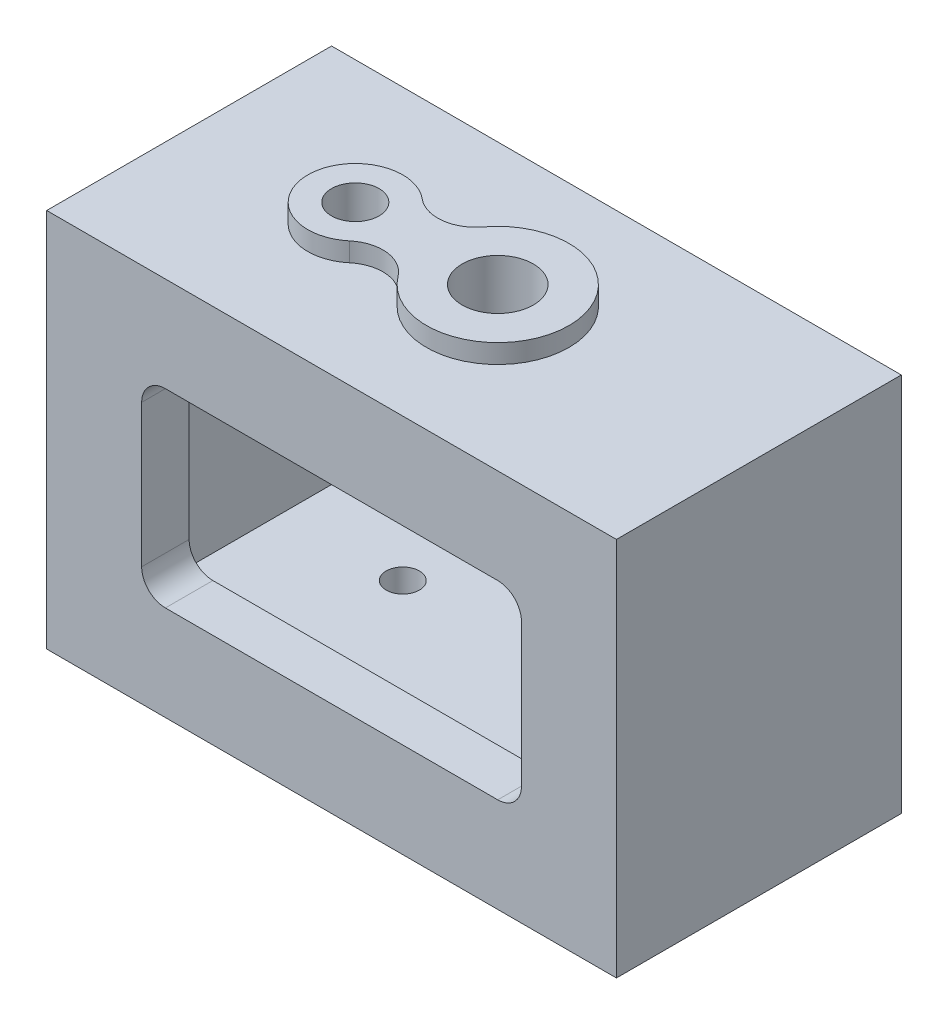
ISO-10303-21;
HEADER;
FILE_DESCRIPTION(('STEP AP214'),'2;1');
FILE_NAME('part.step','',(''),(''),'','','');
FILE_SCHEMA(('AUTOMOTIVE_DESIGN { 1 0 10303 214 1 1 1 1 }'));
ENDSEC;
DATA;
#1=APPLICATION_CONTEXT('core data for automotive mechanical design processes');
#2=APPLICATION_PROTOCOL_DEFINITION('international standard','automotive_design',2000,#1);
#3=PRODUCT_CONTEXT('',#1,'mechanical');
#4=PRODUCT('Part','Part','',(#3));
#5=PRODUCT_RELATED_PRODUCT_CATEGORY('part','',(#4));
#6=PRODUCT_DEFINITION_FORMATION('','',#4);
#7=PRODUCT_DEFINITION_CONTEXT('part definition',#1,'design');
#8=PRODUCT_DEFINITION('design','',#6,#7);
#9=PRODUCT_DEFINITION_SHAPE('','',#8);
#10=(LENGTH_UNIT() NAMED_UNIT(*) SI_UNIT(.MILLI.,.METRE.));
#11=(NAMED_UNIT(*) PLANE_ANGLE_UNIT() SI_UNIT($,.RADIAN.));
#12=(NAMED_UNIT(*) SI_UNIT($,.STERADIAN.) SOLID_ANGLE_UNIT());
#13=UNCERTAINTY_MEASURE_WITH_UNIT(LENGTH_MEASURE(1.E-05),#10,'distance_accuracy_value','');
#14=(GEOMETRIC_REPRESENTATION_CONTEXT(3) GLOBAL_UNCERTAINTY_ASSIGNED_CONTEXT((#13)) GLOBAL_UNIT_ASSIGNED_CONTEXT((#10,
#11,#12)) REPRESENTATION_CONTEXT('',''));
#15=CARTESIAN_POINT('',(0.,0.,0.));
#16=DIRECTION('',(0.,0.,1.));
#17=DIRECTION('',(1.,0.,0.));
#18=AXIS2_PLACEMENT_3D('',#15,#16,#17);
#19=CARTESIAN_POINT('',(-60.,-10.,-30.));
#20=DIRECTION('',(0.,-1.,0.));
#21=DIRECTION('',(0.,0.,-1.));
#22=AXIS2_PLACEMENT_3D('',#19,#20,#21);
#23=PLANE('',#22);
#24=DIRECTION('',(0.,0.,-1.));
#25=VECTOR('',#24,1.);
#26=CARTESIAN_POINT('',(-60.,-10.,30.));
#27=LINE('',#26,#25);
#28=CARTESIAN_POINT('',(-60.,-10.,30.));
#29=VERTEX_POINT('',#28);
#30=CARTESIAN_POINT('',(-60.,-10.,-30.));
#31=VERTEX_POINT('',#30);
#32=EDGE_CURVE('E246',#29,#31,#27,.T.);
#33=ORIENTED_EDGE('',*,*,#32,.T.);
#34=DIRECTION('',(1.,0.,0.));
#35=VECTOR('',#34,1.);
#36=CARTESIAN_POINT('',(-60.,-10.,-30.));
#37=LINE('',#36,#35);
#38=CARTESIAN_POINT('',(60.,-10.,-30.));
#39=VERTEX_POINT('',#38);
#40=EDGE_CURVE('E262',#31,#39,#37,.T.);
#41=ORIENTED_EDGE('',*,*,#40,.T.);
#42=DIRECTION('',(0.,0.,1.));
#43=VECTOR('',#42,1.);
#44=CARTESIAN_POINT('',(60.,-10.,30.));
#45=LINE('',#44,#43);
#46=CARTESIAN_POINT('',(60.,-10.,30.));
#47=VERTEX_POINT('',#46);
#48=EDGE_CURVE('E265',#39,#47,#45,.T.);
#49=ORIENTED_EDGE('',*,*,#48,.T.);
#50=DIRECTION('',(-1.,0.,0.));
#51=VECTOR('',#50,1.);
#52=CARTESIAN_POINT('',(-60.,-10.,30.));
#53=LINE('',#52,#51);
#54=EDGE_CURVE('E268',#47,#29,#53,.T.);
#55=ORIENTED_EDGE('',*,*,#54,.T.);
#56=EDGE_LOOP('',(#33,#41,#49,#55));
#57=FACE_BOUND('',#56,.T.);
#58=CARTESIAN_POINT('',(-25.,-10.,-10.));
#59=DIRECTION('',(0.,-1.,0.));
#60=DIRECTION('',(0.,0.,-1.));
#61=AXIS2_PLACEMENT_3D('',#58,#59,#60);
#62=CIRCLE('',#61,7.);
#63=CARTESIAN_POINT('',(-25.,-10.,-17.));
#64=VERTEX_POINT('',#63);
#65=EDGE_CURVE('E367',#64,#64,#62,.T.);
#66=ORIENTED_EDGE('',*,*,#65,.F.);
#67=EDGE_LOOP('',(#66));
#68=FACE_BOUND('',#67,.T.);
#69=ADVANCED_FACE('F31',(#57,#68),#23,.T.);
#70=CARTESIAN_POINT('',(-60.,70.,30.));
#71=DIRECTION('',(0.,1.,0.));
#72=DIRECTION('',(0.,0.,1.));
#73=AXIS2_PLACEMENT_3D('',#70,#71,#72);
#74=PLANE('',#73);
#75=DIRECTION('',(0.,0.,1.));
#76=VECTOR('',#75,1.);
#77=CARTESIAN_POINT('',(-60.,70.,-30.));
#78=LINE('',#77,#76);
#79=CARTESIAN_POINT('',(-60.,70.,-30.));
#80=VERTEX_POINT('',#79);
#81=CARTESIAN_POINT('',(-60.,70.,30.));
#82=VERTEX_POINT('',#81);
#83=EDGE_CURVE('E271',#80,#82,#78,.T.);
#84=ORIENTED_EDGE('',*,*,#83,.T.);
#85=DIRECTION('',(1.,0.,0.));
#86=VECTOR('',#85,1.);
#87=CARTESIAN_POINT('',(-60.,70.,30.));
#88=LINE('',#87,#86);
#89=CARTESIAN_POINT('',(60.,70.,30.));
#90=VERTEX_POINT('',#89);
#91=EDGE_CURVE('E274',#82,#90,#88,.T.);
#92=ORIENTED_EDGE('',*,*,#91,.T.);
#93=DIRECTION('',(0.,0.,-1.));
#94=VECTOR('',#93,1.);
#95=CARTESIAN_POINT('',(60.,70.,-30.));
#96=LINE('',#95,#94);
#97=CARTESIAN_POINT('',(60.,70.,-30.));
#98=VERTEX_POINT('',#97);
#99=EDGE_CURVE('E277',#90,#98,#96,.T.);
#100=ORIENTED_EDGE('',*,*,#99,.T.);
#101=DIRECTION('',(-1.,0.,0.));
#102=VECTOR('',#101,1.);
#103=CARTESIAN_POINT('',(-60.,70.,-30.));
#104=LINE('',#103,#102);
#105=EDGE_CURVE('E280',#98,#80,#104,.T.);
#106=ORIENTED_EDGE('',*,*,#105,.T.);
#107=EDGE_LOOP('',(#84,#92,#100,#106));
#108=FACE_BOUND('',#107,.T.);
#109=CARTESIAN_POINT('',(-25.,70.,0.));
#110=DIRECTION('',(0.,1.,0.));
#111=DIRECTION('',(0.,0.,1.));
#112=AXIS2_PLACEMENT_3D('',#109,#110,#111);
#113=CIRCLE('',#112,10.);
#114=CARTESIAN_POINT('',(-18.5648148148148,70.,-7.65430543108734));
#115=VERTEX_POINT('',#114);
#116=CARTESIAN_POINT('',(-18.5648148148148,70.,7.65430543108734));
#117=VERTEX_POINT('',#116);
#118=EDGE_CURVE('E342',#115,#117,#113,.T.);
#119=ORIENTED_EDGE('',*,*,#118,.F.);
#120=CARTESIAN_POINT('',(-13.4166666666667,70.,-13.7777497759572));
#121=DIRECTION('',(0.,-1.,0.));
#122=DIRECTION('',(0.,0.,1.));
#123=AXIS2_PLACEMENT_3D('',#120,#121,#122);
#124=CIRCLE('',#123,8.);
#125=CARTESIAN_POINT('',(-7.01086956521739,70.,-8.98548898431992));
#126=VERTEX_POINT('',#125);
#127=EDGE_CURVE('E191',#126,#115,#124,.T.);
#128=ORIENTED_EDGE('',*,*,#127,.F.);
#129=CARTESIAN_POINT('',(5.,70.,0.));
#130=DIRECTION('',(0.,1.,0.));
#131=DIRECTION('',(0.,0.,1.));
#132=AXIS2_PLACEMENT_3D('',#129,#130,#131);
#133=CIRCLE('',#132,15.);
#134=CARTESIAN_POINT('',(-7.01086956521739,70.,8.98548898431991));
#135=VERTEX_POINT('',#134);
#136=EDGE_CURVE('E187',#135,#126,#133,.T.);
#137=ORIENTED_EDGE('',*,*,#136,.F.);
#138=CARTESIAN_POINT('',(-13.4166666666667,70.,13.7777497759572));
#139=DIRECTION('',(0.,-1.,0.));
#140=DIRECTION('',(0.,0.,-1.));
#141=AXIS2_PLACEMENT_3D('',#138,#139,#140);
#142=CIRCLE('',#141,8.);
#143=EDGE_CURVE('E344',#117,#135,#142,.T.);
#144=ORIENTED_EDGE('',*,*,#143,.F.);
#145=EDGE_LOOP('',(#119,#128,#137,#144));
#146=FACE_BOUND('',#145,.T.);
#147=ADVANCED_FACE('F337',(#108,#146),#74,.T.);
#148=CARTESIAN_POINT('',(-60.,60.,-30.));
#149=DIRECTION('',(1.,0.,0.));
#150=DIRECTION('',(0.,0.,-1.));
#151=AXIS2_PLACEMENT_3D('',#148,#149,#150);
#152=PLANE('',#151);
#153=DIRECTION('',(0.,-1.,0.));
#154=VECTOR('',#153,1.);
#155=CARTESIAN_POINT('',(-60.,60.,-30.));
#156=LINE('',#155,#154);
#157=EDGE_CURVE('E316',#80,#31,#156,.T.);
#158=ORIENTED_EDGE('',*,*,#157,.T.);
#159=ORIENTED_EDGE('',*,*,#32,.F.);
#160=DIRECTION('',(0.,-1.,0.));
#161=VECTOR('',#160,1.);
#162=CARTESIAN_POINT('',(-60.,60.,30.));
#163=LINE('',#162,#161);
#164=EDGE_CURVE('E11',#82,#29,#163,.T.);
#165=ORIENTED_EDGE('',*,*,#164,.F.);
#166=ORIENTED_EDGE('',*,*,#83,.F.);
#167=EDGE_LOOP('',(#158,#159,#165,#166));
#168=FACE_BOUND('',#167,.T.);
#169=ADVANCED_FACE('F33',(#168),#152,.F.);
#170=CARTESIAN_POINT('',(-60.,60.,30.));
#171=DIRECTION('',(0.,0.,-1.));
#172=DIRECTION('',(-1.,0.,0.));
#173=AXIS2_PLACEMENT_3D('',#170,#171,#172);
#174=PLANE('',#173);
#175=DIRECTION('',(0.,-1.,0.));
#176=VECTOR('',#175,1.);
#177=CARTESIAN_POINT('',(-40.,45.,30.));
#178=LINE('',#177,#176);
#179=CARTESIAN_POINT('',(-40.,45.,30.));
#180=VERTEX_POINT('',#179);
#181=CARTESIAN_POINT('',(-40.,15.,30.));
#182=VERTEX_POINT('',#181);
#183=EDGE_CURVE('E194',#180,#182,#178,.T.);
#184=ORIENTED_EDGE('',*,*,#183,.F.);
#185=CARTESIAN_POINT('',(-35.,45.,30.));
#186=DIRECTION('',(0.,0.,1.));
#187=DIRECTION('',(-1.,0.,0.));
#188=AXIS2_PLACEMENT_3D('',#185,#186,#187);
#189=CIRCLE('',#188,5.);
#190=CARTESIAN_POINT('',(-35.,50.,30.));
#191=VERTEX_POINT('',#190);
#192=EDGE_CURVE('E54',#191,#180,#189,.T.);
#193=ORIENTED_EDGE('',*,*,#192,.F.);
#194=DIRECTION('',(-1.,0.,0.));
#195=VECTOR('',#194,1.);
#196=CARTESIAN_POINT('',(35.,50.,30.));
#197=LINE('',#196,#195);
#198=CARTESIAN_POINT('',(35.,50.,30.));
#199=VERTEX_POINT('',#198);
#200=EDGE_CURVE('E203',#199,#191,#197,.T.);
#201=ORIENTED_EDGE('',*,*,#200,.F.);
#202=CARTESIAN_POINT('',(35.,45.,30.));
#203=DIRECTION('',(0.,0.,1.));
#204=DIRECTION('',(1.,0.,0.));
#205=AXIS2_PLACEMENT_3D('',#202,#203,#204);
#206=CIRCLE('',#205,5.);
#207=CARTESIAN_POINT('',(40.,45.,30.));
#208=VERTEX_POINT('',#207);
#209=EDGE_CURVE('E239',#208,#199,#206,.T.);
#210=ORIENTED_EDGE('',*,*,#209,.F.);
#211=DIRECTION('',(0.,1.,0.));
#212=VECTOR('',#211,1.);
#213=CARTESIAN_POINT('',(40.,15.,30.));
#214=LINE('',#213,#212);
#215=CARTESIAN_POINT('',(40.,15.,30.));
#216=VERTEX_POINT('',#215);
#217=EDGE_CURVE('E236',#216,#208,#214,.T.);
#218=ORIENTED_EDGE('',*,*,#217,.F.);
#219=CARTESIAN_POINT('',(35.,15.,30.));
#220=DIRECTION('',(0.,0.,1.));
#221=DIRECTION('',(1.,0.,0.));
#222=AXIS2_PLACEMENT_3D('',#219,#220,#221);
#223=CIRCLE('',#222,5.);
#224=CARTESIAN_POINT('',(35.,10.,30.));
#225=VERTEX_POINT('',#224);
#226=EDGE_CURVE('E233',#225,#216,#223,.T.);
#227=ORIENTED_EDGE('',*,*,#226,.F.);
#228=DIRECTION('',(1.,0.,0.));
#229=VECTOR('',#228,1.);
#230=CARTESIAN_POINT('',(-35.,10.,30.));
#231=LINE('',#230,#229);
#232=CARTESIAN_POINT('',(-35.,10.,30.));
#233=VERTEX_POINT('',#232);
#234=EDGE_CURVE('E230',#233,#225,#231,.T.);
#235=ORIENTED_EDGE('',*,*,#234,.F.);
#236=CARTESIAN_POINT('',(-35.,15.,30.));
#237=DIRECTION('',(0.,0.,1.));
#238=DIRECTION('',(-1.,0.,0.));
#239=AXIS2_PLACEMENT_3D('',#236,#237,#238);
#240=CIRCLE('',#239,5.);
#241=EDGE_CURVE('E227',#182,#233,#240,.T.);
#242=ORIENTED_EDGE('',*,*,#241,.F.);
#243=EDGE_LOOP('',(#184,#193,#201,#210,#218,#227,#235,#242));
#244=FACE_BOUND('',#243,.T.);
#245=ORIENTED_EDGE('',*,*,#164,.T.);
#246=ORIENTED_EDGE('',*,*,#54,.F.);
#247=DIRECTION('',(0.,-1.,0.));
#248=VECTOR('',#247,1.);
#249=CARTESIAN_POINT('',(60.,60.,30.));
#250=LINE('',#249,#248);
#251=EDGE_CURVE('E39',#90,#47,#250,.T.);
#252=ORIENTED_EDGE('',*,*,#251,.F.);
#253=ORIENTED_EDGE('',*,*,#91,.F.);
#254=EDGE_LOOP('',(#245,#246,#252,#253));
#255=FACE_BOUND('',#254,.T.);
#256=ADVANCED_FACE('F330',(#244,#255),#174,.F.);
#257=CARTESIAN_POINT('',(60.,60.,-30.));
#258=DIRECTION('',(-1.,0.,0.));
#259=DIRECTION('',(0.,0.,1.));
#260=AXIS2_PLACEMENT_3D('',#257,#258,#259);
#261=PLANE('',#260);
#262=ORIENTED_EDGE('',*,*,#251,.T.);
#263=ORIENTED_EDGE('',*,*,#48,.F.);
#264=DIRECTION('',(0.,-1.,0.));
#265=VECTOR('',#264,1.);
#266=CARTESIAN_POINT('',(60.,60.,-30.));
#267=LINE('',#266,#265);
#268=EDGE_CURVE('E318',#98,#39,#267,.T.);
#269=ORIENTED_EDGE('',*,*,#268,.F.);
#270=ORIENTED_EDGE('',*,*,#99,.F.);
#271=EDGE_LOOP('',(#262,#263,#269,#270));
#272=FACE_BOUND('',#271,.T.);
#273=ADVANCED_FACE('F322',(#272),#261,.F.);
#274=CARTESIAN_POINT('',(-60.,60.,-30.));
#275=DIRECTION('',(0.,0.,1.));
#276=DIRECTION('',(1.,0.,0.));
#277=AXIS2_PLACEMENT_3D('',#274,#275,#276);
#278=PLANE('',#277);
#279=ORIENTED_EDGE('',*,*,#268,.T.);
#280=ORIENTED_EDGE('',*,*,#40,.F.);
#281=ORIENTED_EDGE('',*,*,#157,.F.);
#282=ORIENTED_EDGE('',*,*,#105,.F.);
#283=EDGE_LOOP('',(#279,#280,#281,#282));
#284=FACE_BOUND('',#283,.T.);
#285=ADVANCED_FACE('F335',(#284),#278,.F.);
#286=CARTESIAN_POINT('',(-35.,45.,20.));
#287=DIRECTION('',(0.,0.,1.));
#288=DIRECTION('',(1.,0.,0.));
#289=AXIS2_PLACEMENT_3D('',#286,#287,#288);
#290=CYLINDRICAL_SURFACE('',#289,5.);
#291=ORIENTED_EDGE('',*,*,#192,.T.);
#292=DIRECTION('',(0.,0.,1.));
#293=VECTOR('',#292,1.);
#294=CARTESIAN_POINT('',(-40.,45.,20.));
#295=LINE('',#294,#293);
#296=CARTESIAN_POINT('',(-40.,45.,20.));
#297=VERTEX_POINT('',#296);
#298=EDGE_CURVE('E223',#297,#180,#295,.T.);
#299=ORIENTED_EDGE('',*,*,#298,.F.);
#300=CARTESIAN_POINT('',(-35.,45.,20.));
#301=DIRECTION('',(0.,0.,1.));
#302=DIRECTION('',(-1.,0.,0.));
#303=AXIS2_PLACEMENT_3D('',#300,#301,#302);
#304=CIRCLE('',#303,5.);
#305=CARTESIAN_POINT('',(-35.,50.,20.));
#306=VERTEX_POINT('',#305);
#307=EDGE_CURVE('E199',#306,#297,#304,.T.);
#308=ORIENTED_EDGE('',*,*,#307,.F.);
#309=DIRECTION('',(0.,0.,1.));
#310=VECTOR('',#309,1.);
#311=CARTESIAN_POINT('',(-35.,50.,20.));
#312=LINE('',#311,#310);
#313=EDGE_CURVE('E244',#306,#191,#312,.T.);
#314=ORIENTED_EDGE('',*,*,#313,.T.);
#315=EDGE_LOOP('',(#291,#299,#308,#314));
#316=FACE_BOUND('',#315,.T.);
#317=ADVANCED_FACE('F400',(#316),#290,.F.);
#318=CARTESIAN_POINT('',(35.,50.,20.));
#319=DIRECTION('',(0.,1.,0.));
#320=DIRECTION('',(0.,0.,1.));
#321=AXIS2_PLACEMENT_3D('',#318,#319,#320);
#322=PLANE('',#321);
#323=ORIENTED_EDGE('',*,*,#200,.T.);
#324=ORIENTED_EDGE('',*,*,#313,.F.);
#325=DIRECTION('',(-1.,0.,0.));
#326=VECTOR('',#325,1.);
#327=CARTESIAN_POINT('',(35.,50.,20.));
#328=LINE('',#327,#326);
#329=CARTESIAN_POINT('',(35.,50.,20.));
#330=VERTEX_POINT('',#329);
#331=EDGE_CURVE('E221',#330,#306,#328,.T.);
#332=ORIENTED_EDGE('',*,*,#331,.F.);
#333=DIRECTION('',(0.,0.,1.));
#334=VECTOR('',#333,1.);
#335=CARTESIAN_POINT('',(35.,50.,20.));
#336=LINE('',#335,#334);
#337=EDGE_CURVE('E247',#330,#199,#336,.T.);
#338=ORIENTED_EDGE('',*,*,#337,.T.);
#339=EDGE_LOOP('',(#323,#324,#332,#338));
#340=FACE_BOUND('',#339,.T.);
#341=ADVANCED_FACE('F445',(#340),#322,.F.);
#342=CARTESIAN_POINT('',(35.,45.,20.));
#343=DIRECTION('',(0.,0.,1.));
#344=DIRECTION('',(1.,0.,0.));
#345=AXIS2_PLACEMENT_3D('',#342,#343,#344);
#346=CYLINDRICAL_SURFACE('',#345,5.);
#347=ORIENTED_EDGE('',*,*,#209,.T.);
#348=ORIENTED_EDGE('',*,*,#337,.F.);
#349=CARTESIAN_POINT('',(35.,45.,20.));
#350=DIRECTION('',(0.,0.,1.));
#351=DIRECTION('',(1.,0.,0.));
#352=AXIS2_PLACEMENT_3D('',#349,#350,#351);
#353=CIRCLE('',#352,5.);
#354=CARTESIAN_POINT('',(40.,45.,20.));
#355=VERTEX_POINT('',#354);
#356=EDGE_CURVE('E218',#355,#330,#353,.T.);
#357=ORIENTED_EDGE('',*,*,#356,.F.);
#358=DIRECTION('',(0.,0.,1.));
#359=VECTOR('',#358,1.);
#360=CARTESIAN_POINT('',(40.,45.,20.));
#361=LINE('',#360,#359);
#362=EDGE_CURVE('E249',#355,#208,#361,.T.);
#363=ORIENTED_EDGE('',*,*,#362,.T.);
#364=EDGE_LOOP('',(#347,#348,#357,#363));
#365=FACE_BOUND('',#364,.T.);
#366=ADVANCED_FACE('F450',(#365),#346,.F.);
#367=CARTESIAN_POINT('',(40.,15.,20.));
#368=DIRECTION('',(1.,0.,0.));
#369=DIRECTION('',(0.,0.,-1.));
#370=AXIS2_PLACEMENT_3D('',#367,#368,#369);
#371=PLANE('',#370);
#372=ORIENTED_EDGE('',*,*,#217,.T.);
#373=ORIENTED_EDGE('',*,*,#362,.F.);
#374=DIRECTION('',(0.,1.,0.));
#375=VECTOR('',#374,1.);
#376=CARTESIAN_POINT('',(40.,15.,20.));
#377=LINE('',#376,#375);
#378=CARTESIAN_POINT('',(40.,15.,20.));
#379=VERTEX_POINT('',#378);
#380=EDGE_CURVE('E215',#379,#355,#377,.T.);
#381=ORIENTED_EDGE('',*,*,#380,.F.);
#382=DIRECTION('',(0.,0.,1.));
#383=VECTOR('',#382,1.);
#384=CARTESIAN_POINT('',(40.,15.,20.));
#385=LINE('',#384,#383);
#386=EDGE_CURVE('E251',#379,#216,#385,.T.);
#387=ORIENTED_EDGE('',*,*,#386,.T.);
#388=EDGE_LOOP('',(#372,#373,#381,#387));
#389=FACE_BOUND('',#388,.T.);
#390=ADVANCED_FACE('F453',(#389),#371,.F.);
#391=CARTESIAN_POINT('',(35.,15.,20.));
#392=DIRECTION('',(0.,0.,1.));
#393=DIRECTION('',(1.,0.,0.));
#394=AXIS2_PLACEMENT_3D('',#391,#392,#393);
#395=CYLINDRICAL_SURFACE('',#394,5.);
#396=ORIENTED_EDGE('',*,*,#226,.T.);
#397=ORIENTED_EDGE('',*,*,#386,.F.);
#398=CARTESIAN_POINT('',(35.,15.,20.));
#399=DIRECTION('',(0.,0.,1.));
#400=DIRECTION('',(1.,0.,0.));
#401=AXIS2_PLACEMENT_3D('',#398,#399,#400);
#402=CIRCLE('',#401,5.);
#403=CARTESIAN_POINT('',(35.,10.,20.));
#404=VERTEX_POINT('',#403);
#405=EDGE_CURVE('E212',#404,#379,#402,.T.);
#406=ORIENTED_EDGE('',*,*,#405,.F.);
#407=DIRECTION('',(0.,0.,1.));
#408=VECTOR('',#407,1.);
#409=CARTESIAN_POINT('',(35.,10.,20.));
#410=LINE('',#409,#408);
#411=EDGE_CURVE('E253',#404,#225,#410,.T.);
#412=ORIENTED_EDGE('',*,*,#411,.T.);
#413=EDGE_LOOP('',(#396,#397,#406,#412));
#414=FACE_BOUND('',#413,.T.);
#415=ADVANCED_FACE('F456',(#414),#395,.F.);
#416=CARTESIAN_POINT('',(-35.,10.,20.));
#417=DIRECTION('',(0.,-1.,0.));
#418=DIRECTION('',(0.,0.,-1.));
#419=AXIS2_PLACEMENT_3D('',#416,#417,#418);
#420=PLANE('',#419);
#421=ORIENTED_EDGE('',*,*,#234,.T.);
#422=ORIENTED_EDGE('',*,*,#411,.F.);
#423=DIRECTION('',(1.,0.,0.));
#424=VECTOR('',#423,1.);
#425=CARTESIAN_POINT('',(-35.,10.,20.));
#426=LINE('',#425,#424);
#427=CARTESIAN_POINT('',(-35.,10.,20.));
#428=VERTEX_POINT('',#427);
#429=EDGE_CURVE('E209',#428,#404,#426,.T.);
#430=ORIENTED_EDGE('',*,*,#429,.F.);
#431=DIRECTION('',(0.,0.,1.));
#432=VECTOR('',#431,1.);
#433=CARTESIAN_POINT('',(-35.,10.,20.));
#434=LINE('',#433,#432);
#435=EDGE_CURVE('E255',#428,#233,#434,.T.);
#436=ORIENTED_EDGE('',*,*,#435,.T.);
#437=EDGE_LOOP('',(#421,#422,#430,#436));
#438=FACE_BOUND('',#437,.T.);
#439=ADVANCED_FACE('F458',(#438),#420,.F.);
#440=CARTESIAN_POINT('',(-35.,15.,20.));
#441=DIRECTION('',(0.,0.,1.));
#442=DIRECTION('',(1.,0.,0.));
#443=AXIS2_PLACEMENT_3D('',#440,#441,#442);
#444=CYLINDRICAL_SURFACE('',#443,5.);
#445=ORIENTED_EDGE('',*,*,#241,.T.);
#446=ORIENTED_EDGE('',*,*,#435,.F.);
#447=CARTESIAN_POINT('',(-35.,15.,20.));
#448=DIRECTION('',(0.,0.,1.));
#449=DIRECTION('',(-1.,0.,0.));
#450=AXIS2_PLACEMENT_3D('',#447,#448,#449);
#451=CIRCLE('',#450,5.);
#452=CARTESIAN_POINT('',(-40.,15.,20.));
#453=VERTEX_POINT('',#452);
#454=EDGE_CURVE('E206',#453,#428,#451,.T.);
#455=ORIENTED_EDGE('',*,*,#454,.F.);
#456=DIRECTION('',(0.,0.,1.));
#457=VECTOR('',#456,1.);
#458=CARTESIAN_POINT('',(-40.,15.,20.));
#459=LINE('',#458,#457);
#460=EDGE_CURVE('E257',#453,#182,#459,.T.);
#461=ORIENTED_EDGE('',*,*,#460,.T.);
#462=EDGE_LOOP('',(#445,#446,#455,#461));
#463=FACE_BOUND('',#462,.T.);
#464=ADVANCED_FACE('F461',(#463),#444,.F.);
#465=CARTESIAN_POINT('',(-40.,45.,20.));
#466=DIRECTION('',(-1.,0.,0.));
#467=DIRECTION('',(0.,0.,1.));
#468=AXIS2_PLACEMENT_3D('',#465,#466,#467);
#469=PLANE('',#468);
#470=ORIENTED_EDGE('',*,*,#183,.T.);
#471=ORIENTED_EDGE('',*,*,#460,.F.);
#472=DIRECTION('',(0.,-1.,0.));
#473=VECTOR('',#472,1.);
#474=CARTESIAN_POINT('',(-40.,45.,20.));
#475=LINE('',#474,#473);
#476=EDGE_CURVE('E202',#297,#453,#475,.T.);
#477=ORIENTED_EDGE('',*,*,#476,.F.);
#478=ORIENTED_EDGE('',*,*,#298,.T.);
#479=EDGE_LOOP('',(#470,#471,#477,#478));
#480=FACE_BOUND('',#479,.T.);
#481=ADVANCED_FACE('F404',(#480),#469,.F.);
#482=CARTESIAN_POINT('',(-60.,0.,-30.));
#483=DIRECTION('',(0.,-1.,0.));
#484=DIRECTION('',(0.,0.,-1.));
#485=AXIS2_PLACEMENT_3D('',#482,#483,#484);
#486=PLANE('',#485);
#487=CARTESIAN_POINT('',(-25.,0.,-10.));
#488=DIRECTION('',(0.,-1.,0.));
#489=DIRECTION('',(0.,0.,-1.));
#490=AXIS2_PLACEMENT_3D('',#487,#488,#489);
#491=CIRCLE('',#490,3.5);
#492=CARTESIAN_POINT('',(-25.,0.,-13.5));
#493=VERTEX_POINT('',#492);
#494=EDGE_CURVE('E375',#493,#493,#491,.T.);
#495=ORIENTED_EDGE('',*,*,#494,.T.);
#496=EDGE_LOOP('',(#495));
#497=FACE_BOUND('',#496,.T.);
#498=DIRECTION('',(-1.,0.,0.));
#499=VECTOR('',#498,1.);
#500=CARTESIAN_POINT('',(-50.,0.,-20.));
#501=LINE('',#500,#499);
#502=CARTESIAN_POINT('',(50.,0.,-20.));
#503=VERTEX_POINT('',#502);
#504=CARTESIAN_POINT('',(-50.,0.,-20.));
#505=VERTEX_POINT('',#504);
#506=EDGE_CURVE('E283',#503,#505,#501,.T.);
#507=ORIENTED_EDGE('',*,*,#506,.T.);
#508=DIRECTION('',(0.,0.,1.));
#509=VECTOR('',#508,1.);
#510=CARTESIAN_POINT('',(-50.,0.,-20.));
#511=LINE('',#510,#509);
#512=CARTESIAN_POINT('',(-50.,0.,20.));
#513=VERTEX_POINT('',#512);
#514=EDGE_CURVE('E300',#505,#513,#511,.T.);
#515=ORIENTED_EDGE('',*,*,#514,.T.);
#516=DIRECTION('',(1.,0.,0.));
#517=VECTOR('',#516,1.);
#518=CARTESIAN_POINT('',(-50.,0.,20.));
#519=LINE('',#518,#517);
#520=CARTESIAN_POINT('',(50.,0.,20.));
#521=VERTEX_POINT('',#520);
#522=EDGE_CURVE('E303',#513,#521,#519,.T.);
#523=ORIENTED_EDGE('',*,*,#522,.T.);
#524=DIRECTION('',(0.,0.,-1.));
#525=VECTOR('',#524,1.);
#526=CARTESIAN_POINT('',(50.,0.,-20.));
#527=LINE('',#526,#525);
#528=EDGE_CURVE('E288',#521,#503,#527,.T.);
#529=ORIENTED_EDGE('',*,*,#528,.T.);
#530=EDGE_LOOP('',(#507,#515,#523,#529));
#531=FACE_BOUND('',#530,.T.);
#532=ADVANCED_FACE('F379',(#497,#531),#486,.F.);
#533=CARTESIAN_POINT('',(-60.,60.,30.));
#534=DIRECTION('',(0.,1.,0.));
#535=DIRECTION('',(0.,0.,1.));
#536=AXIS2_PLACEMENT_3D('',#533,#534,#535);
#537=PLANE('',#536);
#538=CARTESIAN_POINT('',(5.,60.,0.));
#539=DIRECTION('',(0.,1.,0.));
#540=DIRECTION('',(0.,0.,1.));
#541=AXIS2_PLACEMENT_3D('',#538,#539,#540);
#542=CIRCLE('',#541,7.5);
#543=CARTESIAN_POINT('',(5.,60.,7.5));
#544=VERTEX_POINT('',#543);
#545=EDGE_CURVE('E363',#544,#544,#542,.T.);
#546=ORIENTED_EDGE('',*,*,#545,.T.);
#547=EDGE_LOOP('',(#546));
#548=FACE_BOUND('',#547,.T.);
#549=CARTESIAN_POINT('',(-25.,60.,0.));
#550=DIRECTION('',(0.,1.,0.));
#551=DIRECTION('',(0.,0.,1.));
#552=AXIS2_PLACEMENT_3D('',#549,#550,#551);
#553=CIRCLE('',#552,5.);
#554=CARTESIAN_POINT('',(-25.,60.,5.));
#555=VERTEX_POINT('',#554);
#556=EDGE_CURVE('E360',#555,#555,#553,.T.);
#557=ORIENTED_EDGE('',*,*,#556,.T.);
#558=EDGE_LOOP('',(#557));
#559=FACE_BOUND('',#558,.T.);
#560=DIRECTION('',(-1.,0.,0.));
#561=VECTOR('',#560,1.);
#562=CARTESIAN_POINT('',(-50.,60.,-20.));
#563=LINE('',#562,#561);
#564=CARTESIAN_POINT('',(50.,60.,-20.));
#565=VERTEX_POINT('',#564);
#566=CARTESIAN_POINT('',(-50.,60.,-20.));
#567=VERTEX_POINT('',#566);
#568=EDGE_CURVE('E284',#565,#567,#563,.T.);
#569=ORIENTED_EDGE('',*,*,#568,.F.);
#570=DIRECTION('',(0.,0.,-1.));
#571=VECTOR('',#570,1.);
#572=CARTESIAN_POINT('',(50.,60.,-20.));
#573=LINE('',#572,#571);
#574=CARTESIAN_POINT('',(50.,60.,20.));
#575=VERTEX_POINT('',#574);
#576=EDGE_CURVE('E294',#575,#565,#573,.T.);
#577=ORIENTED_EDGE('',*,*,#576,.F.);
#578=DIRECTION('',(1.,0.,0.));
#579=VECTOR('',#578,1.);
#580=CARTESIAN_POINT('',(-50.,60.,20.));
#581=LINE('',#580,#579);
#582=CARTESIAN_POINT('',(-50.,60.,20.));
#583=VERTEX_POINT('',#582);
#584=EDGE_CURVE('E291',#583,#575,#581,.T.);
#585=ORIENTED_EDGE('',*,*,#584,.F.);
#586=DIRECTION('',(0.,0.,1.));
#587=VECTOR('',#586,1.);
#588=CARTESIAN_POINT('',(-50.,60.,-20.));
#589=LINE('',#588,#587);
#590=EDGE_CURVE('E287',#567,#583,#589,.T.);
#591=ORIENTED_EDGE('',*,*,#590,.F.);
#592=EDGE_LOOP('',(#569,#577,#585,#591));
#593=FACE_BOUND('',#592,.T.);
#594=ADVANCED_FACE('F403',(#548,#559,#593),#537,.F.);
#595=CARTESIAN_POINT('',(50.,60.,-20.));
#596=DIRECTION('',(-1.,0.,0.));
#597=DIRECTION('',(0.,0.,1.));
#598=AXIS2_PLACEMENT_3D('',#595,#596,#597);
#599=PLANE('',#598);
#600=ORIENTED_EDGE('',*,*,#528,.F.);
#601=DIRECTION('',(0.,-1.,0.));
#602=VECTOR('',#601,1.);
#603=CARTESIAN_POINT('',(50.,60.,20.));
#604=LINE('',#603,#602);
#605=EDGE_CURVE('E309',#575,#521,#604,.T.);
#606=ORIENTED_EDGE('',*,*,#605,.F.);
#607=ORIENTED_EDGE('',*,*,#576,.T.);
#608=DIRECTION('',(0.,-1.,0.));
#609=VECTOR('',#608,1.);
#610=CARTESIAN_POINT('',(50.,60.,-20.));
#611=LINE('',#610,#609);
#612=EDGE_CURVE('E297',#565,#503,#611,.T.);
#613=ORIENTED_EDGE('',*,*,#612,.T.);
#614=EDGE_LOOP('',(#600,#606,#607,#613));
#615=FACE_BOUND('',#614,.T.);
#616=ADVANCED_FACE('F408',(#615),#599,.T.);
#617=CARTESIAN_POINT('',(-50.,60.,20.));
#618=DIRECTION('',(0.,0.,-1.));
#619=DIRECTION('',(-1.,0.,0.));
#620=AXIS2_PLACEMENT_3D('',#617,#618,#619);
#621=PLANE('',#620);
#622=ORIENTED_EDGE('',*,*,#307,.T.);
#623=ORIENTED_EDGE('',*,*,#476,.T.);
#624=ORIENTED_EDGE('',*,*,#454,.T.);
#625=ORIENTED_EDGE('',*,*,#429,.T.);
#626=ORIENTED_EDGE('',*,*,#405,.T.);
#627=ORIENTED_EDGE('',*,*,#380,.T.);
#628=ORIENTED_EDGE('',*,*,#356,.T.);
#629=ORIENTED_EDGE('',*,*,#331,.T.);
#630=EDGE_LOOP('',(#622,#623,#624,#625,#626,#627,#628,#629));
#631=FACE_BOUND('',#630,.T.);
#632=ORIENTED_EDGE('',*,*,#522,.F.);
#633=DIRECTION('',(0.,-1.,0.));
#634=VECTOR('',#633,1.);
#635=CARTESIAN_POINT('',(-50.,60.,20.));
#636=LINE('',#635,#634);
#637=EDGE_CURVE('E311',#583,#513,#636,.T.);
#638=ORIENTED_EDGE('',*,*,#637,.F.);
#639=ORIENTED_EDGE('',*,*,#584,.T.);
#640=ORIENTED_EDGE('',*,*,#605,.T.);
#641=EDGE_LOOP('',(#632,#638,#639,#640));
#642=FACE_BOUND('',#641,.T.);
#643=ADVANCED_FACE('F412',(#631,#642),#621,.T.);
#644=CARTESIAN_POINT('',(-50.,60.,-20.));
#645=DIRECTION('',(1.,0.,0.));
#646=DIRECTION('',(0.,0.,-1.));
#647=AXIS2_PLACEMENT_3D('',#644,#645,#646);
#648=PLANE('',#647);
#649=ORIENTED_EDGE('',*,*,#514,.F.);
#650=DIRECTION('',(0.,-1.,0.));
#651=VECTOR('',#650,1.);
#652=CARTESIAN_POINT('',(-50.,60.,-20.));
#653=LINE('',#652,#651);
#654=EDGE_CURVE('E313',#567,#505,#653,.T.);
#655=ORIENTED_EDGE('',*,*,#654,.F.);
#656=ORIENTED_EDGE('',*,*,#590,.T.);
#657=ORIENTED_EDGE('',*,*,#637,.T.);
#658=EDGE_LOOP('',(#649,#655,#656,#657));
#659=FACE_BOUND('',#658,.T.);
#660=ADVANCED_FACE('F416',(#659),#648,.T.);
#661=CARTESIAN_POINT('',(-50.,60.,-20.));
#662=DIRECTION('',(0.,0.,1.));
#663=DIRECTION('',(1.,0.,0.));
#664=AXIS2_PLACEMENT_3D('',#661,#662,#663);
#665=PLANE('',#664);
#666=ORIENTED_EDGE('',*,*,#506,.F.);
#667=ORIENTED_EDGE('',*,*,#612,.F.);
#668=ORIENTED_EDGE('',*,*,#568,.T.);
#669=ORIENTED_EDGE('',*,*,#654,.T.);
#670=EDGE_LOOP('',(#666,#667,#668,#669));
#671=FACE_BOUND('',#670,.T.);
#672=ADVANCED_FACE('F420',(#671),#665,.T.);
#673=CARTESIAN_POINT('',(-4.20833333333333,74.,-6.8888748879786));
#674=DIRECTION('',(0.,1.,0.));
#675=DIRECTION('',(0.,0.,1.));
#676=AXIS2_PLACEMENT_3D('',#673,#674,#675);
#677=PLANE('',#676);
#678=CARTESIAN_POINT('',(-25.,74.,0.));
#679=DIRECTION('',(0.,1.,0.));
#680=DIRECTION('',(0.,0.,1.));
#681=AXIS2_PLACEMENT_3D('',#678,#679,#680);
#682=CIRCLE('',#681,5.);
#683=CARTESIAN_POINT('',(-25.,74.,5.));
#684=VERTEX_POINT('',#683);
#685=EDGE_CURVE('E347',#684,#684,#682,.T.);
#686=ORIENTED_EDGE('',*,*,#685,.F.);
#687=EDGE_LOOP('',(#686));
#688=FACE_BOUND('',#687,.T.);
#689=CARTESIAN_POINT('',(-13.4166666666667,74.,-13.7777497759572));
#690=DIRECTION('',(0.,-1.,0.));
#691=DIRECTION('',(0.,0.,1.));
#692=AXIS2_PLACEMENT_3D('',#689,#690,#691);
#693=CIRCLE('',#692,8.);
#694=CARTESIAN_POINT('',(-7.01086956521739,74.,-8.98548898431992));
#695=VERTEX_POINT('',#694);
#696=CARTESIAN_POINT('',(-18.5648148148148,74.,-7.65430543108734));
#697=VERTEX_POINT('',#696);
#698=EDGE_CURVE('E178',#695,#697,#693,.T.);
#699=ORIENTED_EDGE('',*,*,#698,.T.);
#700=CARTESIAN_POINT('',(-25.,74.,0.));
#701=DIRECTION('',(0.,1.,0.));
#702=DIRECTION('',(0.,0.,1.));
#703=AXIS2_PLACEMENT_3D('',#700,#701,#702);
#704=CIRCLE('',#703,10.);
#705=CARTESIAN_POINT('',(-18.5648148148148,74.,7.65430543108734));
#706=VERTEX_POINT('',#705);
#707=EDGE_CURVE('E167',#697,#706,#704,.T.);
#708=ORIENTED_EDGE('',*,*,#707,.T.);
#709=CARTESIAN_POINT('',(-13.4166666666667,74.,13.7777497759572));
#710=DIRECTION('',(0.,-1.,0.));
#711=DIRECTION('',(0.,0.,-1.));
#712=AXIS2_PLACEMENT_3D('',#709,#710,#711);
#713=CIRCLE('',#712,8.);
#714=CARTESIAN_POINT('',(-7.01086956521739,74.,8.98548898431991));
#715=VERTEX_POINT('',#714);
#716=EDGE_CURVE('E177',#706,#715,#713,.T.);
#717=ORIENTED_EDGE('',*,*,#716,.T.);
#718=CARTESIAN_POINT('',(5.,74.,0.));
#719=DIRECTION('',(0.,1.,0.));
#720=DIRECTION('',(0.,0.,1.));
#721=AXIS2_PLACEMENT_3D('',#718,#719,#720);
#722=CIRCLE('',#721,15.);
#723=EDGE_CURVE('E183',#715,#695,#722,.T.);
#724=ORIENTED_EDGE('',*,*,#723,.T.);
#725=EDGE_LOOP('',(#699,#708,#717,#724));
#726=FACE_BOUND('',#725,.T.);
#727=CARTESIAN_POINT('',(5.,74.,0.));
#728=DIRECTION('',(0.,1.,0.));
#729=DIRECTION('',(0.,0.,1.));
#730=AXIS2_PLACEMENT_3D('',#727,#728,#729);
#731=CIRCLE('',#730,7.5);
#732=CARTESIAN_POINT('',(5.,74.,7.5));
#733=VERTEX_POINT('',#732);
#734=EDGE_CURVE('E357',#733,#733,#731,.T.);
#735=ORIENTED_EDGE('',*,*,#734,.F.);
#736=EDGE_LOOP('',(#735));
#737=FACE_BOUND('',#736,.T.);
#738=ADVANCED_FACE('F181',(#688,#726,#737),#677,.T.);
#739=CARTESIAN_POINT('',(-13.4166666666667,74.,-13.7777497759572));
#740=DIRECTION('',(0.,-1.,0.));
#741=DIRECTION('',(0.,0.,-1.));
#742=AXIS2_PLACEMENT_3D('',#739,#740,#741);
#743=CYLINDRICAL_SURFACE('',#742,8.);
#744=ORIENTED_EDGE('',*,*,#127,.T.);
#745=DIRECTION('',(0.,-1.,0.));
#746=VECTOR('',#745,1.);
#747=CARTESIAN_POINT('',(-18.5648148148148,74.,-7.65430543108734));
#748=LINE('',#747,#746);
#749=EDGE_CURVE('E171',#697,#115,#748,.T.);
#750=ORIENTED_EDGE('',*,*,#749,.F.);
#751=ORIENTED_EDGE('',*,*,#698,.F.);
#752=DIRECTION('',(0.,-1.,0.));
#753=VECTOR('',#752,1.);
#754=CARTESIAN_POINT('',(-7.01086956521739,74.,-8.98548898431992));
#755=LINE('',#754,#753);
#756=EDGE_CURVE('E352',#695,#126,#755,.T.);
#757=ORIENTED_EDGE('',*,*,#756,.T.);
#758=EDGE_LOOP('',(#744,#750,#751,#757));
#759=FACE_BOUND('',#758,.T.);
#760=ADVANCED_FACE('F189',(#759),#743,.F.);
#761=CARTESIAN_POINT('',(-25.,74.,0.));
#762=DIRECTION('',(0.,-1.,0.));
#763=DIRECTION('',(0.,0.,-1.));
#764=AXIS2_PLACEMENT_3D('',#761,#762,#763);
#765=CYLINDRICAL_SURFACE('',#764,10.);
#766=ORIENTED_EDGE('',*,*,#118,.T.);
#767=DIRECTION('',(0.,-1.,0.));
#768=VECTOR('',#767,1.);
#769=CARTESIAN_POINT('',(-18.5648148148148,74.,7.65430543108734));
#770=LINE('',#769,#768);
#771=EDGE_CURVE('E174',#706,#117,#770,.T.);
#772=ORIENTED_EDGE('',*,*,#771,.F.);
#773=ORIENTED_EDGE('',*,*,#707,.F.);
#774=ORIENTED_EDGE('',*,*,#749,.T.);
#775=EDGE_LOOP('',(#766,#772,#773,#774));
#776=FACE_BOUND('',#775,.T.);
#777=ADVANCED_FACE('F169',(#776),#765,.T.);
#778=CARTESIAN_POINT('',(-13.4166666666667,74.,13.7777497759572));
#779=DIRECTION('',(0.,-1.,0.));
#780=DIRECTION('',(0.,0.,-1.));
#781=AXIS2_PLACEMENT_3D('',#778,#779,#780);
#782=CYLINDRICAL_SURFACE('',#781,8.);
#783=ORIENTED_EDGE('',*,*,#143,.T.);
#784=DIRECTION('',(0.,-1.,0.));
#785=VECTOR('',#784,1.);
#786=CARTESIAN_POINT('',(-7.01086956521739,74.,8.98548898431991));
#787=LINE('',#786,#785);
#788=EDGE_CURVE('E46',#715,#135,#787,.T.);
#789=ORIENTED_EDGE('',*,*,#788,.F.);
#790=ORIENTED_EDGE('',*,*,#716,.F.);
#791=ORIENTED_EDGE('',*,*,#771,.T.);
#792=EDGE_LOOP('',(#783,#789,#790,#791));
#793=FACE_BOUND('',#792,.T.);
#794=ADVANCED_FACE('F482',(#793),#782,.F.);
#795=CARTESIAN_POINT('',(5.,74.,0.));
#796=DIRECTION('',(0.,-1.,0.));
#797=DIRECTION('',(0.,0.,-1.));
#798=AXIS2_PLACEMENT_3D('',#795,#796,#797);
#799=CYLINDRICAL_SURFACE('',#798,15.);
#800=ORIENTED_EDGE('',*,*,#136,.T.);
#801=ORIENTED_EDGE('',*,*,#756,.F.);
#802=ORIENTED_EDGE('',*,*,#723,.F.);
#803=ORIENTED_EDGE('',*,*,#788,.T.);
#804=EDGE_LOOP('',(#800,#801,#802,#803));
#805=FACE_BOUND('',#804,.T.);
#806=ADVANCED_FACE('F485',(#805),#799,.T.);
#807=CARTESIAN_POINT('',(-25.,74.,0.));
#808=DIRECTION('',(0.,-1.,0.));
#809=DIRECTION('',(0.,0.,-1.));
#810=AXIS2_PLACEMENT_3D('',#807,#808,#809);
#811=CYLINDRICAL_SURFACE('',#810,5.);
#812=ORIENTED_EDGE('',*,*,#685,.T.);
#813=EDGE_LOOP('',(#812));
#814=FACE_BOUND('',#813,.T.);
#815=ORIENTED_EDGE('',*,*,#556,.F.);
#816=EDGE_LOOP('',(#815));
#817=FACE_BOUND('',#816,.T.);
#818=ADVANCED_FACE('F489',(#814,#817),#811,.F.);
#819=CARTESIAN_POINT('',(5.,74.,0.));
#820=DIRECTION('',(0.,-1.,0.));
#821=DIRECTION('',(0.,0.,-1.));
#822=AXIS2_PLACEMENT_3D('',#819,#820,#821);
#823=CYLINDRICAL_SURFACE('',#822,7.5);
#824=ORIENTED_EDGE('',*,*,#734,.T.);
#825=EDGE_LOOP('',(#824));
#826=FACE_BOUND('',#825,.T.);
#827=ORIENTED_EDGE('',*,*,#545,.F.);
#828=EDGE_LOOP('',(#827));
#829=FACE_BOUND('',#828,.T.);
#830=ADVANCED_FACE('F495',(#826,#829),#823,.F.);
#831=CARTESIAN_POINT('',(-25.,-14.,-10.));
#832=DIRECTION('',(0.,-1.,0.));
#833=DIRECTION('',(0.,0.,-1.));
#834=AXIS2_PLACEMENT_3D('',#831,#832,#833);
#835=PLANE('',#834);
#836=CARTESIAN_POINT('',(-25.,-14.,-10.));
#837=DIRECTION('',(0.,-1.,0.));
#838=DIRECTION('',(0.,0.,-1.));
#839=AXIS2_PLACEMENT_3D('',#836,#837,#838);
#840=CIRCLE('',#839,7.);
#841=CARTESIAN_POINT('',(-25.,-14.,-17.));
#842=VERTEX_POINT('',#841);
#843=EDGE_CURVE('E366',#842,#842,#840,.T.);
#844=ORIENTED_EDGE('',*,*,#843,.T.);
#845=EDGE_LOOP('',(#844));
#846=FACE_BOUND('',#845,.T.);
#847=CARTESIAN_POINT('',(-25.,-14.,-10.));
#848=DIRECTION('',(0.,-1.,0.));
#849=DIRECTION('',(0.,0.,-1.));
#850=AXIS2_PLACEMENT_3D('',#847,#848,#849);
#851=CIRCLE('',#850,3.5);
#852=CARTESIAN_POINT('',(-25.,-14.,-13.5));
#853=VERTEX_POINT('',#852);
#854=EDGE_CURVE('E370',#853,#853,#851,.T.);
#855=ORIENTED_EDGE('',*,*,#854,.F.);
#856=EDGE_LOOP('',(#855));
#857=FACE_BOUND('',#856,.T.);
#858=ADVANCED_FACE('F390',(#846,#857),#835,.T.);
#859=CARTESIAN_POINT('',(-25.,-14.,-10.));
#860=DIRECTION('',(0.,1.,0.));
#861=DIRECTION('',(0.,0.,1.));
#862=AXIS2_PLACEMENT_3D('',#859,#860,#861);
#863=CYLINDRICAL_SURFACE('',#862,7.);
#864=ORIENTED_EDGE('',*,*,#843,.F.);
#865=EDGE_LOOP('',(#864));
#866=FACE_BOUND('',#865,.T.);
#867=ORIENTED_EDGE('',*,*,#65,.T.);
#868=EDGE_LOOP('',(#867));
#869=FACE_BOUND('',#868,.T.);
#870=ADVANCED_FACE('F384',(#866,#869),#863,.T.);
#871=CARTESIAN_POINT('',(-25.,-14.,-10.));
#872=DIRECTION('',(0.,1.,0.));
#873=DIRECTION('',(0.,0.,1.));
#874=AXIS2_PLACEMENT_3D('',#871,#872,#873);
#875=CYLINDRICAL_SURFACE('',#874,3.5);
#876=ORIENTED_EDGE('',*,*,#854,.T.);
#877=EDGE_LOOP('',(#876));
#878=FACE_BOUND('',#877,.T.);
#879=ORIENTED_EDGE('',*,*,#494,.F.);
#880=EDGE_LOOP('',(#879));
#881=FACE_BOUND('',#880,.T.);
#882=ADVANCED_FACE('F382',(#878,#881),#875,.F.);
#883=CLOSED_SHELL('',(#69,#147,#169,#256,#273,#285,#317,#341,#366,#390,#415,#439,#464,#481,#532,
#594,#616,#643,#660,#672,#738,#760,#777,#794,#806,#818,#830,#858,#870,#882));
#884=MANIFOLD_SOLID_BREP('B2',#883);
#885=ADVANCED_BREP_SHAPE_REPRESENTATION('',(#18,#884),#14);
#886=SHAPE_DEFINITION_REPRESENTATION(#9,#885);
ENDSEC;
END-ISO-10303-21;
